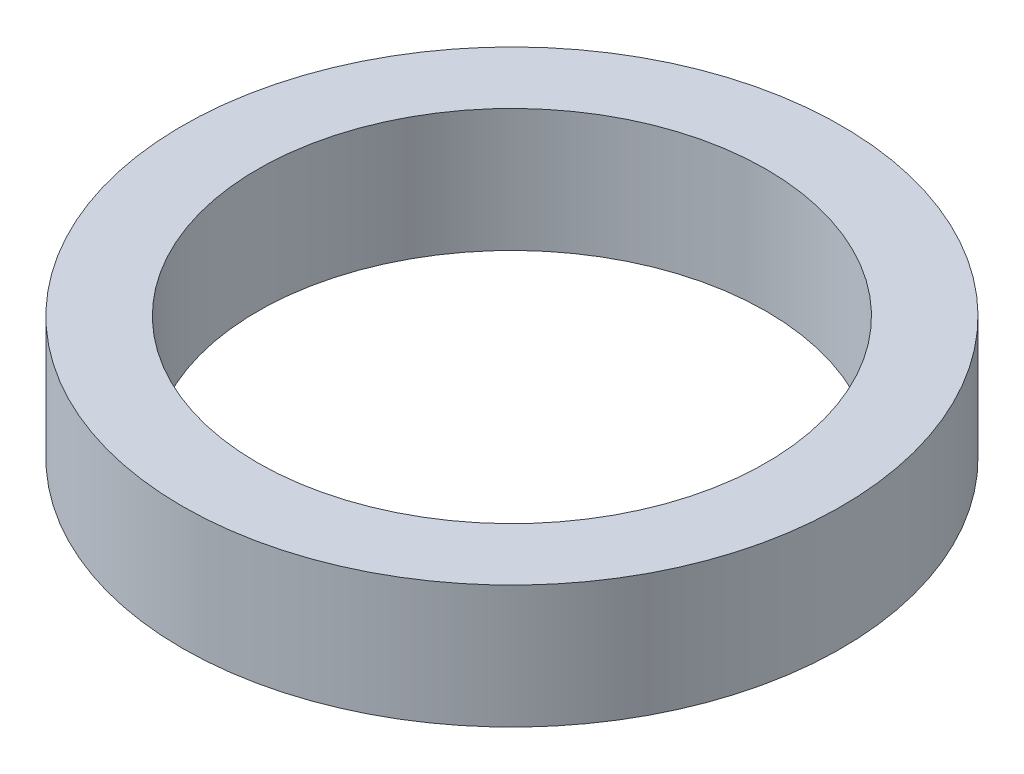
ISO-10303-21;
HEADER;
FILE_DESCRIPTION(('STEP AP214'),'2;1');
FILE_NAME('part.step','',(''),(''),'','','');
FILE_SCHEMA(('AUTOMOTIVE_DESIGN { 1 0 10303 214 1 1 1 1 }'));
ENDSEC;
DATA;
#1=APPLICATION_CONTEXT('core data for automotive mechanical design processes');
#2=APPLICATION_PROTOCOL_DEFINITION('international standard','automotive_design',2000,#1);
#3=PRODUCT_CONTEXT('',#1,'mechanical');
#4=PRODUCT('Part','Part','',(#3));
#5=PRODUCT_RELATED_PRODUCT_CATEGORY('part','',(#4));
#6=PRODUCT_DEFINITION_FORMATION('','',#4);
#7=PRODUCT_DEFINITION_CONTEXT('part definition',#1,'design');
#8=PRODUCT_DEFINITION('design','',#6,#7);
#9=PRODUCT_DEFINITION_SHAPE('','',#8);
#10=(LENGTH_UNIT() NAMED_UNIT(*) SI_UNIT(.MILLI.,.METRE.));
#11=(NAMED_UNIT(*) PLANE_ANGLE_UNIT() SI_UNIT($,.RADIAN.));
#12=(NAMED_UNIT(*) SI_UNIT($,.STERADIAN.) SOLID_ANGLE_UNIT());
#13=UNCERTAINTY_MEASURE_WITH_UNIT(LENGTH_MEASURE(1.E-05),#10,'distance_accuracy_value','');
#14=(GEOMETRIC_REPRESENTATION_CONTEXT(3) GLOBAL_UNCERTAINTY_ASSIGNED_CONTEXT((#13)) GLOBAL_UNIT_ASSIGNED_CONTEXT((#10,
#11,#12)) REPRESENTATION_CONTEXT('',''));
#15=CARTESIAN_POINT('',(0.,0.,0.));
#16=DIRECTION('',(0.,0.,1.));
#17=DIRECTION('',(1.,0.,0.));
#18=AXIS2_PLACEMENT_3D('',#15,#16,#17);
#19=CARTESIAN_POINT('',(0.,4.9,0.));
#20=DIRECTION('',(0.,1.,0.));
#21=DIRECTION('',(0.,0.,1.));
#22=AXIS2_PLACEMENT_3D('',#19,#20,#21);
#23=PLANE('',#22);
#24=CARTESIAN_POINT('',(0.,4.9,0.));
#25=DIRECTION('',(0.,1.,0.));
#26=DIRECTION('',(0.,0.,1.));
#27=AXIS2_PLACEMENT_3D('',#24,#25,#26);
#28=CIRCLE('',#27,13.13);
#29=CARTESIAN_POINT('',(0.,4.9,13.13));
#30=VERTEX_POINT('',#29);
#31=EDGE_CURVE('E10',#30,#30,#28,.T.);
#32=ORIENTED_EDGE('',*,*,#31,.T.);
#33=EDGE_LOOP('',(#32));
#34=FACE_BOUND('',#33,.T.);
#35=CARTESIAN_POINT('',(0.,4.9,0.));
#36=DIRECTION('',(0.,1.,0.));
#37=DIRECTION('',(0.,0.,1.));
#38=AXIS2_PLACEMENT_3D('',#35,#36,#37);
#39=CIRCLE('',#38,10.13);
#40=CARTESIAN_POINT('',(0.,4.9,10.13));
#41=VERTEX_POINT('',#40);
#42=EDGE_CURVE('E52',#41,#41,#39,.T.);
#43=ORIENTED_EDGE('',*,*,#42,.F.);
#44=EDGE_LOOP('',(#43));
#45=FACE_BOUND('',#44,.T.);
#46=ADVANCED_FACE('F39',(#34,#45),#23,.T.);
#47=CARTESIAN_POINT('',(0.,0.,0.));
#48=DIRECTION('',(0.,1.,0.));
#49=DIRECTION('',(0.,0.,1.));
#50=AXIS2_PLACEMENT_3D('',#47,#48,#49);
#51=PLANE('',#50);
#52=CARTESIAN_POINT('',(0.,0.,0.));
#53=DIRECTION('',(0.,1.,0.));
#54=DIRECTION('',(0.,0.,1.));
#55=AXIS2_PLACEMENT_3D('',#52,#53,#54);
#56=CIRCLE('',#55,13.13);
#57=CARTESIAN_POINT('',(0.,0.,13.13));
#58=VERTEX_POINT('',#57);
#59=EDGE_CURVE('E43',#58,#58,#56,.T.);
#60=ORIENTED_EDGE('',*,*,#59,.F.);
#61=EDGE_LOOP('',(#60));
#62=FACE_BOUND('',#61,.T.);
#63=CARTESIAN_POINT('',(0.,0.,0.));
#64=DIRECTION('',(0.,1.,0.));
#65=DIRECTION('',(0.,0.,1.));
#66=AXIS2_PLACEMENT_3D('',#63,#64,#65);
#67=CIRCLE('',#66,10.13);
#68=CARTESIAN_POINT('',(0.,0.,10.13));
#69=VERTEX_POINT('',#68);
#70=EDGE_CURVE('E54',#69,#69,#67,.T.);
#71=ORIENTED_EDGE('',*,*,#70,.T.);
#72=EDGE_LOOP('',(#71));
#73=FACE_BOUND('',#72,.T.);
#74=ADVANCED_FACE('F66',(#62,#73),#51,.F.);
#75=CARTESIAN_POINT('',(0.,4.9,0.));
#76=DIRECTION('',(0.,-1.,0.));
#77=DIRECTION('',(0.,0.,-1.));
#78=AXIS2_PLACEMENT_3D('',#75,#76,#77);
#79=CYLINDRICAL_SURFACE('',#78,13.13);
#80=ORIENTED_EDGE('',*,*,#31,.F.);
#81=EDGE_LOOP('',(#80));
#82=FACE_BOUND('',#81,.T.);
#83=ORIENTED_EDGE('',*,*,#59,.T.);
#84=EDGE_LOOP('',(#83));
#85=FACE_BOUND('',#84,.T.);
#86=ADVANCED_FACE('F41',(#82,#85),#79,.T.);
#87=CARTESIAN_POINT('',(0.,4.9,0.));
#88=DIRECTION('',(0.,-1.,0.));
#89=DIRECTION('',(0.,0.,-1.));
#90=AXIS2_PLACEMENT_3D('',#87,#88,#89);
#91=CYLINDRICAL_SURFACE('',#90,10.13);
#92=ORIENTED_EDGE('',*,*,#42,.T.);
#93=EDGE_LOOP('',(#92));
#94=FACE_BOUND('',#93,.T.);
#95=ORIENTED_EDGE('',*,*,#70,.F.);
#96=EDGE_LOOP('',(#95));
#97=FACE_BOUND('',#96,.T.);
#98=ADVANCED_FACE('F62',(#94,#97),#91,.F.);
#99=CLOSED_SHELL('',(#46,#74,#86,#98));
#100=MANIFOLD_SOLID_BREP('B2',#99);
#101=ADVANCED_BREP_SHAPE_REPRESENTATION('',(#18,#100),#14);
#102=SHAPE_DEFINITION_REPRESENTATION(#9,#101);
ENDSEC;
END-ISO-10303-21;
